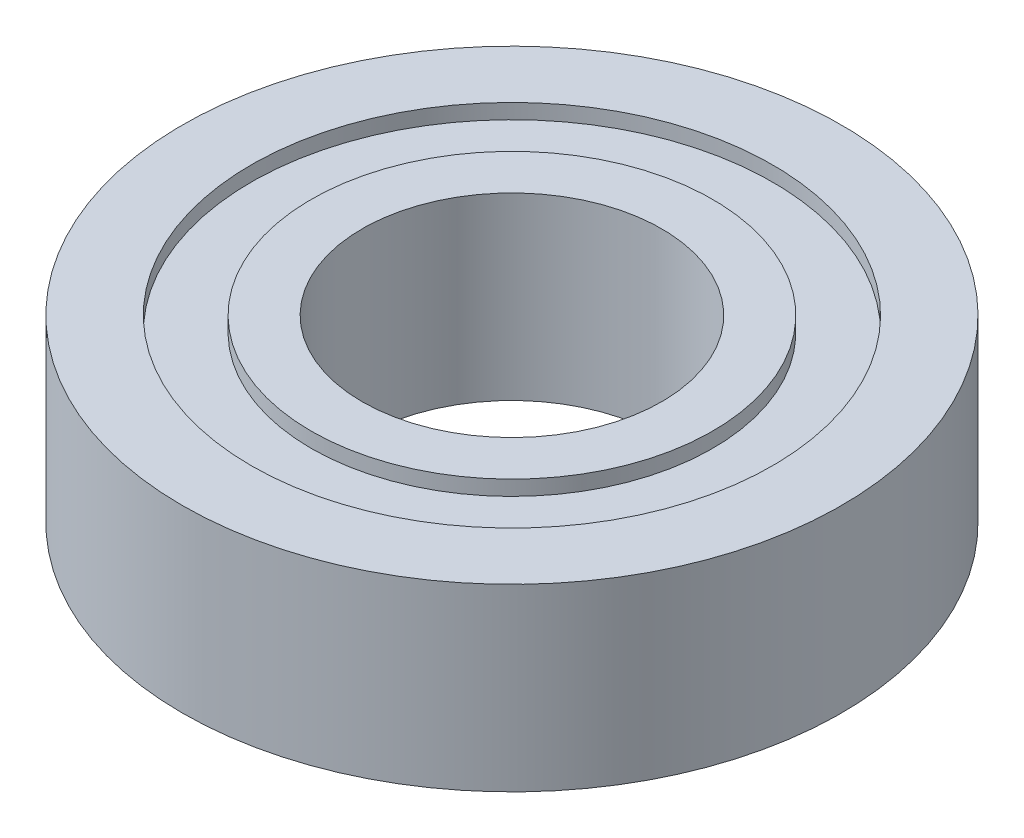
ISO-10303-21;
HEADER;
FILE_DESCRIPTION(('STEP AP214'),'2;1');
FILE_NAME('part.step','',(''),(''),'','','');
FILE_SCHEMA(('AUTOMOTIVE_DESIGN { 1 0 10303 214 1 1 1 1 }'));
ENDSEC;
DATA;
#1=APPLICATION_CONTEXT('core data for automotive mechanical design processes');
#2=APPLICATION_PROTOCOL_DEFINITION('international standard','automotive_design',2000,#1);
#3=PRODUCT_CONTEXT('',#1,'mechanical');
#4=PRODUCT('Part','Part','',(#3));
#5=PRODUCT_RELATED_PRODUCT_CATEGORY('part','',(#4));
#6=PRODUCT_DEFINITION_FORMATION('','',#4);
#7=PRODUCT_DEFINITION_CONTEXT('part definition',#1,'design');
#8=PRODUCT_DEFINITION('design','',#6,#7);
#9=PRODUCT_DEFINITION_SHAPE('','',#8);
#10=(LENGTH_UNIT() NAMED_UNIT(*) SI_UNIT(.MILLI.,.METRE.));
#11=(NAMED_UNIT(*) PLANE_ANGLE_UNIT() SI_UNIT($,.RADIAN.));
#12=(NAMED_UNIT(*) SI_UNIT($,.STERADIAN.) SOLID_ANGLE_UNIT());
#13=UNCERTAINTY_MEASURE_WITH_UNIT(LENGTH_MEASURE(1.E-05),#10,'distance_accuracy_value','');
#14=(GEOMETRIC_REPRESENTATION_CONTEXT(3) GLOBAL_UNCERTAINTY_ASSIGNED_CONTEXT((#13)) GLOBAL_UNIT_ASSIGNED_CONTEXT((#10,
#11,#12)) REPRESENTATION_CONTEXT('',''));
#15=CARTESIAN_POINT('',(0.,0.,0.));
#16=DIRECTION('',(0.,0.,1.));
#17=DIRECTION('',(1.,0.,0.));
#18=AXIS2_PLACEMENT_3D('',#15,#16,#17);
#19=CARTESIAN_POINT('',(0.,-3.,0.));
#20=DIRECTION('',(0.,1.,0.));
#21=DIRECTION('',(0.,0.,1.));
#22=AXIS2_PLACEMENT_3D('',#19,#20,#21);
#23=PLANE('',#22);
#24=CARTESIAN_POINT('',(0.,-3.,0.));
#25=DIRECTION('',(0.,1.,0.));
#26=DIRECTION('',(0.,0.,1.));
#27=AXIS2_PLACEMENT_3D('',#24,#25,#26);
#28=CIRCLE('',#27,5.);
#29=CARTESIAN_POINT('',(0.,-3.,5.));
#30=VERTEX_POINT('',#29);
#31=EDGE_CURVE('E43',#30,#30,#28,.T.);
#32=ORIENTED_EDGE('',*,*,#31,.T.);
#33=EDGE_LOOP('',(#32));
#34=FACE_BOUND('',#33,.T.);
#35=CARTESIAN_POINT('',(0.,-3.,0.));
#36=DIRECTION('',(0.,1.,0.));
#37=DIRECTION('',(0.,0.,1.));
#38=AXIS2_PLACEMENT_3D('',#35,#36,#37);
#39=CIRCLE('',#38,6.7);
#40=CARTESIAN_POINT('',(0.,-3.,6.7));
#41=VERTEX_POINT('',#40);
#42=EDGE_CURVE('E75',#41,#41,#39,.T.);
#43=ORIENTED_EDGE('',*,*,#42,.F.);
#44=EDGE_LOOP('',(#43));
#45=FACE_BOUND('',#44,.T.);
#46=ADVANCED_FACE('F36',(#34,#45),#23,.F.);
#47=CARTESIAN_POINT('',(0.,3.,0.));
#48=DIRECTION('',(0.,1.,0.));
#49=DIRECTION('',(0.,0.,1.));
#50=AXIS2_PLACEMENT_3D('',#47,#48,#49);
#51=PLANE('',#50);
#52=CARTESIAN_POINT('',(0.,3.,0.));
#53=DIRECTION('',(0.,1.,0.));
#54=DIRECTION('',(0.,0.,1.));
#55=AXIS2_PLACEMENT_3D('',#52,#53,#54);
#56=CIRCLE('',#55,5.);
#57=CARTESIAN_POINT('',(0.,3.,5.));
#58=VERTEX_POINT('',#57);
#59=EDGE_CURVE('E51',#58,#58,#56,.T.);
#60=ORIENTED_EDGE('',*,*,#59,.F.);
#61=EDGE_LOOP('',(#60));
#62=FACE_BOUND('',#61,.T.);
#63=CARTESIAN_POINT('',(0.,3.,0.));
#64=DIRECTION('',(0.,1.,0.));
#65=DIRECTION('',(0.,0.,1.));
#66=AXIS2_PLACEMENT_3D('',#63,#64,#65);
#67=CIRCLE('',#66,6.7);
#68=CARTESIAN_POINT('',(0.,3.,6.7));
#69=VERTEX_POINT('',#68);
#70=EDGE_CURVE('E63',#69,#69,#67,.T.);
#71=ORIENTED_EDGE('',*,*,#70,.T.);
#72=EDGE_LOOP('',(#71));
#73=FACE_BOUND('',#72,.T.);
#74=ADVANCED_FACE('F91',(#62,#73),#51,.T.);
#75=CARTESIAN_POINT('',(0.,-3.,0.));
#76=DIRECTION('',(0.,1.,0.));
#77=DIRECTION('',(0.,0.,1.));
#78=AXIS2_PLACEMENT_3D('',#75,#76,#77);
#79=CYLINDRICAL_SURFACE('',#78,11.);
#80=CARTESIAN_POINT('',(0.,-3.,0.));
#81=DIRECTION('',(0.,1.,0.));
#82=DIRECTION('',(0.,0.,1.));
#83=AXIS2_PLACEMENT_3D('',#80,#81,#82);
#84=CIRCLE('',#83,11.);
#85=CARTESIAN_POINT('',(0.,-3.,11.));
#86=VERTEX_POINT('',#85);
#87=EDGE_CURVE('E10',#86,#86,#84,.T.);
#88=ORIENTED_EDGE('',*,*,#87,.T.);
#89=EDGE_LOOP('',(#88));
#90=FACE_BOUND('',#89,.T.);
#91=CARTESIAN_POINT('',(0.,3.,0.));
#92=DIRECTION('',(0.,1.,0.));
#93=DIRECTION('',(0.,0.,1.));
#94=AXIS2_PLACEMENT_3D('',#91,#92,#93);
#95=CIRCLE('',#94,11.);
#96=CARTESIAN_POINT('',(0.,3.,11.));
#97=VERTEX_POINT('',#96);
#98=EDGE_CURVE('E47',#97,#97,#95,.T.);
#99=ORIENTED_EDGE('',*,*,#98,.F.);
#100=EDGE_LOOP('',(#99));
#101=FACE_BOUND('',#100,.T.);
#102=ADVANCED_FACE('F38',(#90,#101),#79,.T.);
#103=CARTESIAN_POINT('',(0.,-3.,0.));
#104=DIRECTION('',(0.,1.,0.));
#105=DIRECTION('',(0.,0.,1.));
#106=AXIS2_PLACEMENT_3D('',#103,#104,#105);
#107=CIRCLE('',#106,8.7);
#108=CARTESIAN_POINT('',(0.,-3.,8.7));
#109=VERTEX_POINT('',#108);
#110=EDGE_CURVE('E69',#109,#109,#107,.T.);
#111=ORIENTED_EDGE('',*,*,#110,.T.);
#112=EDGE_LOOP('',(#111));
#113=FACE_BOUND('',#112,.T.);
#114=ORIENTED_EDGE('',*,*,#87,.F.);
#115=EDGE_LOOP('',(#114));
#116=FACE_BOUND('',#115,.T.);
#117=ADVANCED_FACE('F92',(#113,#116),#23,.F.);
#118=CARTESIAN_POINT('',(0.,-3.,0.));
#119=DIRECTION('',(0.,1.,0.));
#120=DIRECTION('',(0.,0.,1.));
#121=AXIS2_PLACEMENT_3D('',#118,#119,#120);
#122=CYLINDRICAL_SURFACE('',#121,5.);
#123=ORIENTED_EDGE('',*,*,#31,.F.);
#124=EDGE_LOOP('',(#123));
#125=FACE_BOUND('',#124,.T.);
#126=ORIENTED_EDGE('',*,*,#59,.T.);
#127=EDGE_LOOP('',(#126));
#128=FACE_BOUND('',#127,.T.);
#129=ADVANCED_FACE('F101',(#125,#128),#122,.F.);
#130=CARTESIAN_POINT('',(0.,3.,0.));
#131=DIRECTION('',(0.,1.,0.));
#132=DIRECTION('',(0.,0.,1.));
#133=AXIS2_PLACEMENT_3D('',#130,#131,#132);
#134=CIRCLE('',#133,8.7);
#135=CARTESIAN_POINT('',(0.,3.,8.7));
#136=VERTEX_POINT('',#135);
#137=EDGE_CURVE('E57',#136,#136,#134,.T.);
#138=ORIENTED_EDGE('',*,*,#137,.F.);
#139=EDGE_LOOP('',(#138));
#140=FACE_BOUND('',#139,.T.);
#141=ORIENTED_EDGE('',*,*,#98,.T.);
#142=EDGE_LOOP('',(#141));
#143=FACE_BOUND('',#142,.T.);
#144=ADVANCED_FACE('F98',(#140,#143),#51,.T.);
#145=CARTESIAN_POINT('',(0.,2.5,0.));
#146=DIRECTION('',(0.,1.,0.));
#147=DIRECTION('',(0.,0.,1.));
#148=AXIS2_PLACEMENT_3D('',#145,#146,#147);
#149=CYLINDRICAL_SURFACE('',#148,8.7);
#150=CARTESIAN_POINT('',(0.,2.5,0.));
#151=DIRECTION('',(0.,1.,0.));
#152=DIRECTION('',(0.,0.,1.));
#153=AXIS2_PLACEMENT_3D('',#150,#151,#152);
#154=CIRCLE('',#153,8.7);
#155=CARTESIAN_POINT('',(0.,2.5,8.7));
#156=VERTEX_POINT('',#155);
#157=EDGE_CURVE('E56',#156,#156,#154,.T.);
#158=ORIENTED_EDGE('',*,*,#157,.F.);
#159=EDGE_LOOP('',(#158));
#160=FACE_BOUND('',#159,.T.);
#161=ORIENTED_EDGE('',*,*,#137,.T.);
#162=EDGE_LOOP('',(#161));
#163=FACE_BOUND('',#162,.T.);
#164=ADVANCED_FACE('F127',(#160,#163),#149,.F.);
#165=CARTESIAN_POINT('',(0.,2.5,0.));
#166=DIRECTION('',(0.,1.,0.));
#167=DIRECTION('',(0.,0.,1.));
#168=AXIS2_PLACEMENT_3D('',#165,#166,#167);
#169=PLANE('',#168);
#170=CARTESIAN_POINT('',(0.,2.5,0.));
#171=DIRECTION('',(0.,1.,0.));
#172=DIRECTION('',(0.,0.,1.));
#173=AXIS2_PLACEMENT_3D('',#170,#171,#172);
#174=CIRCLE('',#173,6.7);
#175=CARTESIAN_POINT('',(0.,2.5,6.7));
#176=VERTEX_POINT('',#175);
#177=EDGE_CURVE('E60',#176,#176,#174,.T.);
#178=ORIENTED_EDGE('',*,*,#177,.F.);
#179=EDGE_LOOP('',(#178));
#180=FACE_BOUND('',#179,.T.);
#181=ORIENTED_EDGE('',*,*,#157,.T.);
#182=EDGE_LOOP('',(#181));
#183=FACE_BOUND('',#182,.T.);
#184=ADVANCED_FACE('F123',(#180,#183),#169,.T.);
#185=CARTESIAN_POINT('',(0.,2.5,0.));
#186=DIRECTION('',(0.,1.,0.));
#187=DIRECTION('',(0.,0.,1.));
#188=AXIS2_PLACEMENT_3D('',#185,#186,#187);
#189=CYLINDRICAL_SURFACE('',#188,6.7);
#190=ORIENTED_EDGE('',*,*,#177,.T.);
#191=EDGE_LOOP('',(#190));
#192=FACE_BOUND('',#191,.T.);
#193=ORIENTED_EDGE('',*,*,#70,.F.);
#194=EDGE_LOOP('',(#193));
#195=FACE_BOUND('',#194,.T.);
#196=ADVANCED_FACE('F117',(#192,#195),#189,.T.);
#197=CARTESIAN_POINT('',(0.,-2.5,0.));
#198=DIRECTION('',(0.,-1.,0.));
#199=DIRECTION('',(0.,0.,1.));
#200=AXIS2_PLACEMENT_3D('',#197,#198,#199);
#201=PLANE('',#200);
#202=CARTESIAN_POINT('',(0.,-2.5,0.));
#203=DIRECTION('',(0.,1.,0.));
#204=DIRECTION('',(0.,0.,1.));
#205=AXIS2_PLACEMENT_3D('',#202,#203,#204);
#206=CIRCLE('',#205,8.7);
#207=CARTESIAN_POINT('',(0.,-2.5,8.7));
#208=VERTEX_POINT('',#207);
#209=EDGE_CURVE('E66',#208,#208,#206,.T.);
#210=ORIENTED_EDGE('',*,*,#209,.F.);
#211=EDGE_LOOP('',(#210));
#212=FACE_BOUND('',#211,.T.);
#213=CARTESIAN_POINT('',(0.,-2.5,0.));
#214=DIRECTION('',(0.,1.,0.));
#215=DIRECTION('',(0.,0.,1.));
#216=AXIS2_PLACEMENT_3D('',#213,#214,#215);
#217=CIRCLE('',#216,6.7);
#218=CARTESIAN_POINT('',(0.,-2.5,6.7));
#219=VERTEX_POINT('',#218);
#220=EDGE_CURVE('E72',#219,#219,#217,.T.);
#221=ORIENTED_EDGE('',*,*,#220,.T.);
#222=EDGE_LOOP('',(#221));
#223=FACE_BOUND('',#222,.T.);
#224=ADVANCED_FACE('F81',(#212,#223),#201,.T.);
#225=CARTESIAN_POINT('',(0.,-2.5,0.));
#226=DIRECTION('',(0.,-1.,0.));
#227=DIRECTION('',(0.,0.,-1.));
#228=AXIS2_PLACEMENT_3D('',#225,#226,#227);
#229=CYLINDRICAL_SURFACE('',#228,8.7);
#230=ORIENTED_EDGE('',*,*,#209,.T.);
#231=EDGE_LOOP('',(#230));
#232=FACE_BOUND('',#231,.T.);
#233=ORIENTED_EDGE('',*,*,#110,.F.);
#234=EDGE_LOOP('',(#233));
#235=FACE_BOUND('',#234,.T.);
#236=ADVANCED_FACE('F86',(#232,#235),#229,.F.);
#237=CARTESIAN_POINT('',(0.,-2.5,0.));
#238=DIRECTION('',(0.,-1.,0.));
#239=DIRECTION('',(0.,0.,-1.));
#240=AXIS2_PLACEMENT_3D('',#237,#238,#239);
#241=CYLINDRICAL_SURFACE('',#240,6.7);
#242=ORIENTED_EDGE('',*,*,#220,.F.);
#243=EDGE_LOOP('',(#242));
#244=FACE_BOUND('',#243,.T.);
#245=ORIENTED_EDGE('',*,*,#42,.T.);
#246=EDGE_LOOP('',(#245));
#247=FACE_BOUND('',#246,.T.);
#248=ADVANCED_FACE('F83',(#244,#247),#241,.T.);
#249=CLOSED_SHELL('',(#46,#74,#102,#117,#129,#144,#164,#184,#196,#224,#236,#248));
#250=MANIFOLD_SOLID_BREP('B2',#249);
#251=ADVANCED_BREP_SHAPE_REPRESENTATION('',(#18,#250),#14);
#252=SHAPE_DEFINITION_REPRESENTATION(#9,#251);
ENDSEC;
END-ISO-10303-21;
